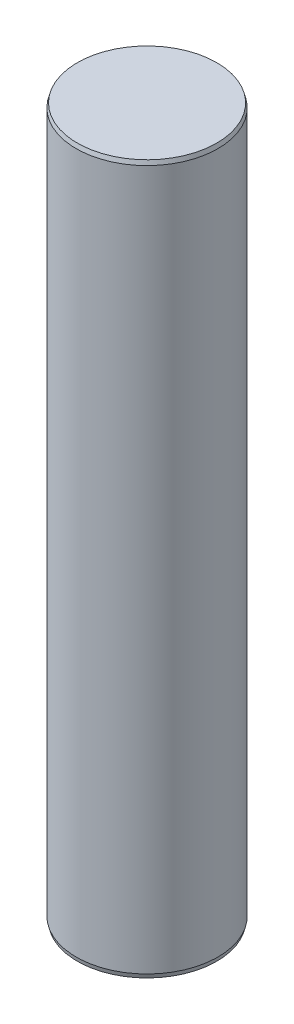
from build123d import *


with BuildPart() as part:
    # Esquisse1 → Base-R_volution (revolve)
    with BuildSketch(Plane.XY, mode=Mode.PRIVATE) as base_r_volution_sk:
        Polygon((2, -19.88), (2, -0.12), (1.967846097, 0), (0, 0), (0, -20), (1.967846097, -20), align=None)
    revolve(base_r_volution_sk.sketch.rotate(Axis((0, 0, 0), (0, 1, 0)), 90), axis=Axis((0, 0, 0), (0, 1, 0)))


solid = part.part
